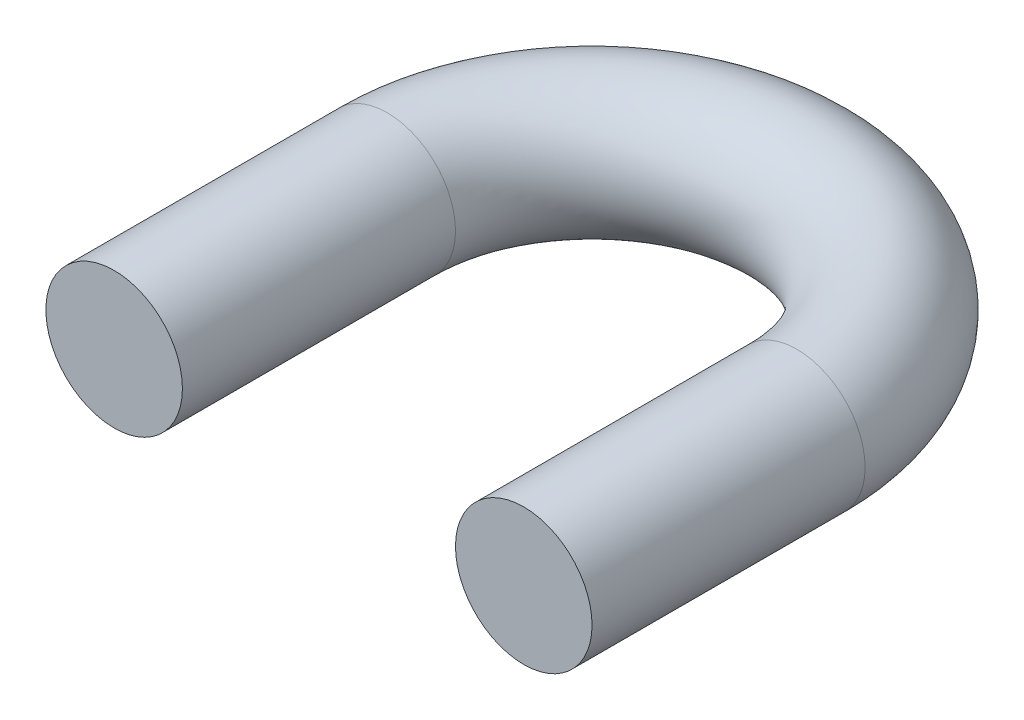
ISO-10303-21;
HEADER;
FILE_DESCRIPTION(('STEP AP214'),'2;1');
FILE_NAME('part.step','',(''),(''),'','','');
FILE_SCHEMA(('AUTOMOTIVE_DESIGN { 1 0 10303 214 1 1 1 1 }'));
ENDSEC;
DATA;
#1=APPLICATION_CONTEXT('core data for automotive mechanical design processes');
#2=APPLICATION_PROTOCOL_DEFINITION('international standard','automotive_design',2000,#1);
#3=PRODUCT_CONTEXT('',#1,'mechanical');
#4=PRODUCT('Part','Part','',(#3));
#5=PRODUCT_RELATED_PRODUCT_CATEGORY('part','',(#4));
#6=PRODUCT_DEFINITION_FORMATION('','',#4);
#7=PRODUCT_DEFINITION_CONTEXT('part definition',#1,'design');
#8=PRODUCT_DEFINITION('design','',#6,#7);
#9=PRODUCT_DEFINITION_SHAPE('','',#8);
#10=(LENGTH_UNIT() NAMED_UNIT(*) SI_UNIT(.MILLI.,.METRE.));
#11=(NAMED_UNIT(*) PLANE_ANGLE_UNIT() SI_UNIT($,.RADIAN.));
#12=(NAMED_UNIT(*) SI_UNIT($,.STERADIAN.) SOLID_ANGLE_UNIT());
#13=UNCERTAINTY_MEASURE_WITH_UNIT(LENGTH_MEASURE(1.E-05),#10,'distance_accuracy_value','');
#14=(GEOMETRIC_REPRESENTATION_CONTEXT(3) GLOBAL_UNCERTAINTY_ASSIGNED_CONTEXT((#13)) GLOBAL_UNIT_ASSIGNED_CONTEXT((#10,
#11,#12)) REPRESENTATION_CONTEXT('',''));
#15=CARTESIAN_POINT('',(0.,0.,0.));
#16=DIRECTION('',(0.,0.,1.));
#17=DIRECTION('',(1.,0.,0.));
#18=AXIS2_PLACEMENT_3D('',#15,#16,#17);
#19=CARTESIAN_POINT('',(7.14375000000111,-1.11022302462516E-12,1.77635683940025E-11));
#20=DIRECTION('',(0.,0.,1.00000000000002));
#21=DIRECTION('',(1.00000000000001,0.,0.));
#22=AXIS2_PLACEMENT_3D('',#19,#20,#21);
#23=CYLINDRICAL_SURFACE('',#22,2.38125);
#24=CARTESIAN_POINT('',(7.14375000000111,-1.11022302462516E-12,1.77635683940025E-11));
#25=DIRECTION('',(0.,0.,-1.00000000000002));
#26=DIRECTION('',(-1.00000000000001,0.,0.));
#27=AXIS2_PLACEMENT_3D('',#24,#25,#26);
#28=CIRCLE('',#27,2.38125);
#29=CARTESIAN_POINT('',(9.525,-1.48029736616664E-12,2.36847578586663E-11));
#30=VERTEX_POINT('',#29);
#31=EDGE_CURVE('E36',#30,#30,#28,.T.);
#32=ORIENTED_EDGE('',*,*,#31,.F.);
#33=EDGE_LOOP('',(#32));
#34=FACE_BOUND('',#33,.T.);
#35=CARTESIAN_POINT('',(7.14375000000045,-4.44089209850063E-12,9.52500000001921));
#36=DIRECTION('',(0.,0.,-1.00000000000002));
#37=DIRECTION('',(-1.00000000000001,0.,0.));
#38=AXIS2_PLACEMENT_3D('',#35,#36,#37);
#39=CIRCLE('',#38,2.38125);
#40=CARTESIAN_POINT('',(4.76250000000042,-4.41703253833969E-12,9.52500000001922));
#41=VERTEX_POINT('',#40);
#42=EDGE_CURVE('E10',#41,#41,#39,.T.);
#43=ORIENTED_EDGE('',*,*,#42,.T.);
#44=EDGE_LOOP('',(#43));
#45=FACE_BOUND('',#44,.T.);
#46=ADVANCED_FACE('F30',(#34,#45),#23,.T.);
#47=CARTESIAN_POINT('',(0.,0.,0.));
#48=DIRECTION('',(0.,-1.00000000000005,0.));
#49=DIRECTION('',(0.,0.,-1.00000000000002));
#50=AXIS2_PLACEMENT_3D('',#47,#48,#49);
#51=TOROIDAL_SURFACE('',#50,7.14375,2.38125);
#52=CARTESIAN_POINT('',(-7.14375000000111,2.88657986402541E-12,1.79856129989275E-11));
#53=DIRECTION('',(0.,0.,1.00000000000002));
#54=DIRECTION('',(1.00000000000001,0.,0.));
#55=AXIS2_PLACEMENT_3D('',#52,#53,#54);
#56=CIRCLE('',#55,2.38125);
#57=CARTESIAN_POINT('',(-9.525,3.84877315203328E-12,2.39808173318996E-11));
#58=VERTEX_POINT('',#57);
#59=EDGE_CURVE('E40',#58,#58,#56,.T.);
#60=CARTESIAN_POINT('',(0.,0.,0.));
#61=DIRECTION('',(0.,-1.00000000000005,0.));
#62=DIRECTION('',(0.,0.,-1.00000000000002));
#63=AXIS2_PLACEMENT_3D('',#60,#61,#62);
#64=CIRCLE('',#63,9.525);
#65=EDGE_CURVE('',#58,#30,#64,.T.);
#66=ORIENTED_EDGE('',*,*,#59,.F.);
#67=ORIENTED_EDGE('',*,*,#31,.T.);
#68=ORIENTED_EDGE('',*,*,#65,.T.);
#69=ORIENTED_EDGE('',*,*,#65,.F.);
#70=EDGE_LOOP('',(#66,#68,#67,#69));
#71=FACE_BOUND('',#70,.T.);
#72=ADVANCED_FACE('F55',(#71),#51,.T.);
#73=CARTESIAN_POINT('',(-7.14375000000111,2.88657986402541E-12,1.79856129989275E-11));
#74=DIRECTION('',(0.,0.,1.00000000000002));
#75=DIRECTION('',(1.,0.,0.));
#76=AXIS2_PLACEMENT_3D('',#73,#74,#75);
#77=CYLINDRICAL_SURFACE('',#76,2.38125);
#78=ORIENTED_EDGE('',*,*,#59,.T.);
#79=EDGE_LOOP('',(#78));
#80=FACE_BOUND('',#79,.T.);
#81=CARTESIAN_POINT('',(-7.14375000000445,-2.66453525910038E-12,9.5250000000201));
#82=DIRECTION('',(0.,0.,1.00000000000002));
#83=DIRECTION('',(1.00000000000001,0.,0.));
#84=AXIS2_PLACEMENT_3D('',#81,#82,#83);
#85=CIRCLE('',#84,2.38125);
#86=CARTESIAN_POINT('',(-4.76250000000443,-2.68846091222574E-12,9.52500000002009));
#87=VERTEX_POINT('',#86);
#88=EDGE_CURVE('E44',#87,#87,#85,.T.);
#89=ORIENTED_EDGE('',*,*,#88,.F.);
#90=EDGE_LOOP('',(#89));
#91=FACE_BOUND('',#90,.T.);
#92=ADVANCED_FACE('F52',(#80,#91),#77,.T.);
#93=CARTESIAN_POINT('',(7.14375000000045,-4.44089209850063E-12,9.52500000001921));
#94=DIRECTION('',(0.,0.,-1.00000000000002));
#95=DIRECTION('',(-1.00000000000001,0.,0.));
#96=AXIS2_PLACEMENT_3D('',#93,#94,#95);
#97=PLANE('',#96);
#98=ORIENTED_EDGE('',*,*,#42,.F.);
#99=EDGE_LOOP('',(#98));
#100=FACE_BOUND('',#99,.T.);
#101=ADVANCED_FACE('F54',(#100),#97,.F.);
#102=CARTESIAN_POINT('',(-7.14375000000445,-2.66453525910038E-12,9.5250000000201));
#103=DIRECTION('',(0.,0.,1.00000000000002));
#104=DIRECTION('',(1.00000000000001,0.,0.));
#105=AXIS2_PLACEMENT_3D('',#102,#103,#104);
#106=PLANE('',#105);
#107=ORIENTED_EDGE('',*,*,#88,.T.);
#108=EDGE_LOOP('',(#107));
#109=FACE_BOUND('',#108,.T.);
#110=ADVANCED_FACE('F50',(#109),#106,.T.);
#111=CLOSED_SHELL('',(#46,#72,#92,#101,#110));
#112=MANIFOLD_SOLID_BREP('B2',#111);
#113=ADVANCED_BREP_SHAPE_REPRESENTATION('',(#18,#112),#14);
#114=SHAPE_DEFINITION_REPRESENTATION(#9,#113);
ENDSEC;
END-ISO-10303-21;
